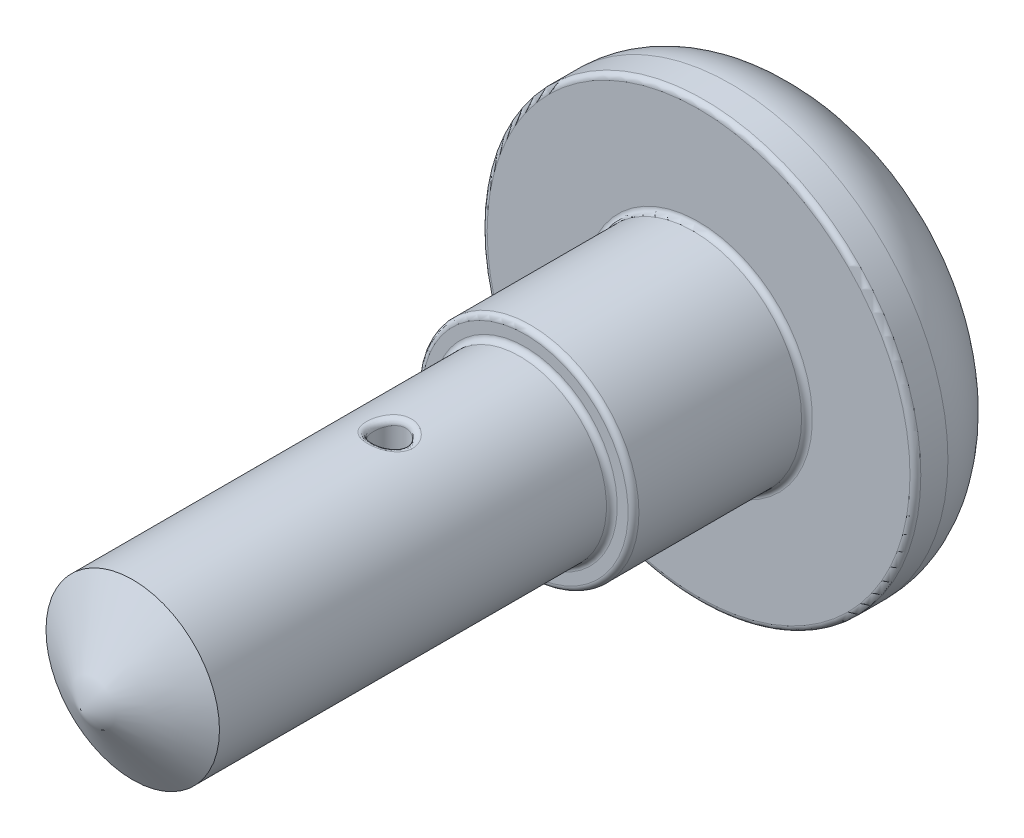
from build123d import *

# Parameters (mm, degrees)
SKETCH_2_R          = 0.75
CUT_EXTRUDE_1_DEPTH = 5
FILLET_2_R          = 0.25


with BuildPart() as part:
    # Sketch 1 → Revolve 1 (revolve)
    with BuildSketch(Plane(origin=(0, 0, 0), x_dir=(0, 0, -1), z_dir=(1, 0, 0)), mode=Mode.PRIVATE) as revolve_1_sk:
        with BuildLine():
            Line((0, 0), (28, 0))
            Line((28, 0), (28, 1.75))
            Line((28, 1.75), (35, 1.75))
            add(Edge.make_bspline(
                [(35, 1.75), (35, 10), (30, 10)],
                knots=[4.71238898, 4.71238898, 4.71238898, 6.283185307, 6.283185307, 6.283185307], degree=2, weights=[1, 0.707106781, 1]))
            Line((30, 10), (28.5, 10))
            Line((28.5, 10), (28.5, 5))
            Line((28.5, 5), (20.5, 5))
            Line((20.5, 5), (20.5, 4))
            Line((20.5, 4), (2.403442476, 4))
            Line((2.403442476, 4), (0, 0))
        make_face()
    revolve(revolve_1_sk.sketch.rotate(Axis((0, 0, 0), (0, 0, -1)), 90), axis=Axis((0, 0, 0), (0, 0, -1)))

    # Sketch 2 → Cut-Extrude 1 (cut, symmetric)
    with BuildSketch(Plane(origin=(0, 0, 0), x_dir=(1, 0, 0), z_dir=(0, 1, 0))):
        with Locations(Location((0, 14.25, 0), (0, 0, 270))):
            Circle(SKETCH_2_R)
    extrude(amount=CUT_EXTRUDE_1_DEPTH, both=True, mode=Mode.SUBTRACT)

    # Fillet 2
    fillet_2_edges = [part.edges().sort_by_distance(p)[0] for p in [
        (-1.75, 0, -28),
        (0, 4.000000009, -14.99999999),
        (0, -4.000000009, -14.99999999),
        (-4, 0, -20.5),
        (-5, 0, -20.5),
        (-5, 0, -28.5),
        (-10, 0, -28.5),
        (-1.75, 0, -35),
    ]]
    fillet(fillet_2_edges, radius=FILLET_2_R)


solid = part.part
